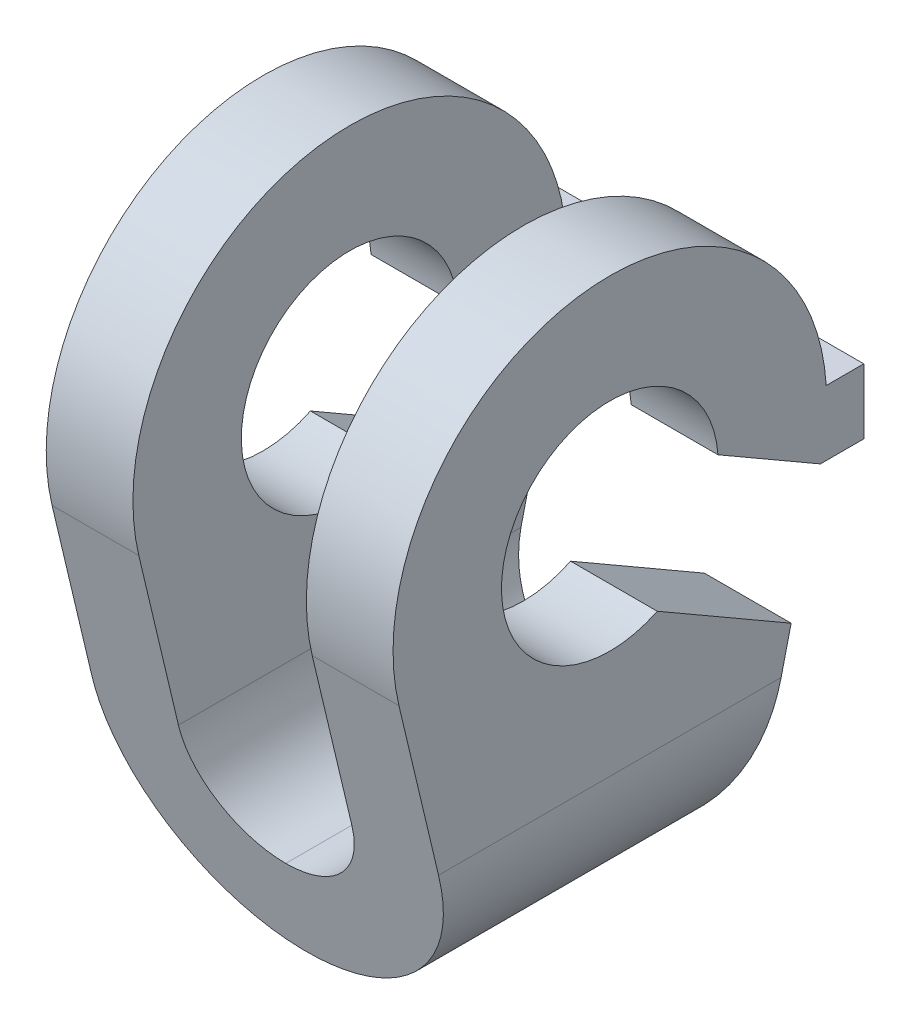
ISO-10303-21;
HEADER;
FILE_DESCRIPTION(('STEP AP214'),'2;1');
FILE_NAME('part.step','',(''),(''),'','','');
FILE_SCHEMA(('AUTOMOTIVE_DESIGN { 1 0 10303 214 1 1 1 1 }'));
ENDSEC;
DATA;
#1=APPLICATION_CONTEXT('core data for automotive mechanical design processes');
#2=APPLICATION_PROTOCOL_DEFINITION('international standard','automotive_design',2000,#1);
#3=PRODUCT_CONTEXT('',#1,'mechanical');
#4=PRODUCT('Part','Part','',(#3));
#5=PRODUCT_RELATED_PRODUCT_CATEGORY('part','',(#4));
#6=PRODUCT_DEFINITION_FORMATION('','',#4);
#7=PRODUCT_DEFINITION_CONTEXT('part definition',#1,'design');
#8=PRODUCT_DEFINITION('design','',#6,#7);
#9=PRODUCT_DEFINITION_SHAPE('','',#8);
#10=(LENGTH_UNIT() NAMED_UNIT(*) SI_UNIT(.MILLI.,.METRE.));
#11=(NAMED_UNIT(*) PLANE_ANGLE_UNIT() SI_UNIT($,.RADIAN.));
#12=(NAMED_UNIT(*) SI_UNIT($,.STERADIAN.) SOLID_ANGLE_UNIT());
#13=UNCERTAINTY_MEASURE_WITH_UNIT(LENGTH_MEASURE(1.E-05),#10,'distance_accuracy_value','');
#14=(GEOMETRIC_REPRESENTATION_CONTEXT(3) GLOBAL_UNCERTAINTY_ASSIGNED_CONTEXT((#13)) GLOBAL_UNIT_ASSIGNED_CONTEXT((#10,
#11,#12)) REPRESENTATION_CONTEXT('',''));
#15=CARTESIAN_POINT('',(0.,0.,0.));
#16=DIRECTION('',(0.,0.,1.));
#17=DIRECTION('',(1.,0.,0.));
#18=AXIS2_PLACEMENT_3D('',#15,#16,#17);
#19=CARTESIAN_POINT('',(-1.,0.,5.));
#20=DIRECTION('',(-1.,0.,0.));
#21=DIRECTION('',(0.,0.,1.));
#22=AXIS2_PLACEMENT_3D('',#19,#20,#21);
#23=PLANE('',#22);
#24=DIRECTION('',(0.,-0.499999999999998,-0.86602540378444));
#25=VECTOR('',#24,1.);
#26=CARTESIAN_POINT('',(-1.,4.31374953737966,2.50945554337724));
#27=LINE('',#26,#25);
#28=CARTESIAN_POINT('',(-1.,3.58840990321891,1.25313044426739));
#29=VERTEX_POINT('',#28);
#30=CARTESIAN_POINT('',(-0.999999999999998,2.90621284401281,0.0715124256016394));
#31=VERTEX_POINT('',#30);
#32=EDGE_CURVE('E252',#29,#31,#27,.T.);
#33=ORIENTED_EDGE('',*,*,#32,.T.);
#34=CARTESIAN_POINT('',(-0.999999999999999,3.5,2.5));
#35=DIRECTION('',(-1.,0.,0.));
#36=DIRECTION('',(0.,0.,1.));
#37=AXIS2_PLACEMENT_3D('',#34,#35,#36);
#38=CIRCLE('',#37,2.5);
#39=CARTESIAN_POINT('',(-1.,3.65621778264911,0.00488557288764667));
#40=VERTEX_POINT('',#39);
#41=EDGE_CURVE('E37',#31,#40,#38,.F.);
#42=ORIENTED_EDGE('',*,*,#41,.T.);
#43=CARTESIAN_POINT('',(-0.999999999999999,2.92185481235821,4.93223110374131));
#44=VERTEX_POINT('',#43);
#45=EDGE_CURVE('E405',#40,#44,#38,.F.);
#46=ORIENTED_EDGE('',*,*,#45,.T.);
#47=DIRECTION('',(0.,-0.972892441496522,-0.231258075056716));
#48=VECTOR('',#47,1.);
#49=CARTESIAN_POINT('',(-1.,0.171508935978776,4.27846953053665));
#50=LINE('',#49,#48);
#51=CARTESIAN_POINT('',(-1.,1.,4.47540316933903));
#52=VERTEX_POINT('',#51);
#53=EDGE_CURVE('E383',#44,#52,#50,.T.);
#54=ORIENTED_EDGE('',*,*,#53,.T.);
#55=DIRECTION('',(0.,0.,-1.));
#56=VECTOR('',#55,1.);
#57=CARTESIAN_POINT('',(-1.,1.,0.));
#58=LINE('',#57,#56);
#59=CARTESIAN_POINT('',(-1.,1.,0.524596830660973));
#60=VERTEX_POINT('',#59);
#61=EDGE_CURVE('E347',#52,#60,#58,.T.);
#62=ORIENTED_EDGE('',*,*,#61,.T.);
#63=DIRECTION('',(0.,0.972892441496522,-0.231258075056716));
#64=VECTOR('',#63,1.);
#65=CARTESIAN_POINT('',(-1.,-0.953437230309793,0.988931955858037));
#66=LINE('',#65,#64);
#67=CARTESIAN_POINT('',(-1.,1.48469231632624,0.409384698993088));
#68=VERTEX_POINT('',#67);
#69=EDGE_CURVE('E396',#60,#68,#66,.T.);
#70=ORIENTED_EDGE('',*,*,#69,.T.);
#71=DIRECTION('',(0.,0.499999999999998,0.86602540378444));
#72=VECTOR('',#71,1.);
#73=CARTESIAN_POINT('',(-1.,3.10131397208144,3.20945554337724));
#74=LINE('',#73,#72);
#75=CARTESIAN_POINT('',(-1.,2.37597433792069,1.95313044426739));
#76=VERTEX_POINT('',#75);
#77=EDGE_CURVE('E59',#68,#76,#74,.T.);
#78=ORIENTED_EDGE('',*,*,#77,.T.);
#79=CARTESIAN_POINT('',(-1.,3.5,2.5));
#80=DIRECTION('',(-1.,0.,0.));
#81=DIRECTION('',(0.,0.,1.));
#82=AXIS2_PLACEMENT_3D('',#79,#80,#81);
#83=CIRCLE('',#82,1.25);
#84=EDGE_CURVE('E357',#76,#29,#83,.T.);
#85=ORIENTED_EDGE('',*,*,#84,.T.);
#86=EDGE_LOOP('',(#33,#42,#46,#54,#62,#70,#78,#85));
#87=FACE_BOUND('',#86,.T.);
#88=ADVANCED_FACE('F33',(#87),#23,.F.);
#89=CARTESIAN_POINT('',(-2.,6.,5.));
#90=DIRECTION('',(1.,0.,0.));
#91=DIRECTION('',(0.,1.,0.));
#92=AXIS2_PLACEMENT_3D('',#89,#90,#91);
#93=PLANE('',#92);
#94=CARTESIAN_POINT('',(-2.,3.5,2.5));
#95=DIRECTION('',(1.,0.,0.));
#96=DIRECTION('',(0.,1.,0.));
#97=AXIS2_PLACEMENT_3D('',#94,#95,#96);
#98=CIRCLE('',#97,2.5);
#99=CARTESIAN_POINT('',(-2.,2.92185481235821,4.93223110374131));
#100=VERTEX_POINT('',#99);
#101=CARTESIAN_POINT('',(-2.,3.65621778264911,0.00488557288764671));
#102=VERTEX_POINT('',#101);
#103=EDGE_CURVE('E399',#100,#102,#98,.F.);
#104=ORIENTED_EDGE('',*,*,#103,.T.);
#105=DIRECTION('',(0.,0.,-1.));
#106=VECTOR('',#105,1.);
#107=CARTESIAN_POINT('',(-2.,3.65621778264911,-0.428460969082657));
#108=LINE('',#107,#106);
#109=CARTESIAN_POINT('',(-2.,3.65621778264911,-0.428460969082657));
#110=VERTEX_POINT('',#109);
#111=EDGE_CURVE('E449',#102,#110,#108,.T.);
#112=ORIENTED_EDGE('',*,*,#111,.T.);
#113=DIRECTION('',(0.,-1.,0.));
#114=VECTOR('',#113,1.);
#115=CARTESIAN_POINT('',(-2.,2.90621778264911,-0.428460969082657));
#116=LINE('',#115,#114);
#117=CARTESIAN_POINT('',(-2.,2.90621778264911,-0.428460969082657));
#118=VERTEX_POINT('',#117);
#119=EDGE_CURVE('E198',#110,#118,#116,.T.);
#120=ORIENTED_EDGE('',*,*,#119,.T.);
#121=DIRECTION('',(0.,0.,1.));
#122=VECTOR('',#121,1.);
#123=CARTESIAN_POINT('',(-2.,2.90621778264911,0.071539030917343));
#124=LINE('',#123,#122);
#125=CARTESIAN_POINT('',(-2.,2.90621778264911,0.0715124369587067));
#126=VERTEX_POINT('',#125);
#127=EDGE_CURVE('E181',#118,#126,#124,.T.);
#128=ORIENTED_EDGE('',*,*,#127,.T.);
#129=DIRECTION('',(0.,0.499999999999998,0.86602540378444));
#130=VECTOR('',#129,1.);
#131=CARTESIAN_POINT('',(-2.,5.81374953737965,5.10753175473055));
#132=LINE('',#131,#130);
#133=CARTESIAN_POINT('',(-2.,3.58840990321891,1.25313044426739));
#134=VERTEX_POINT('',#133);
#135=EDGE_CURVE('E249',#126,#134,#132,.T.);
#136=ORIENTED_EDGE('',*,*,#135,.T.);
#137=CARTESIAN_POINT('',(-2.,3.5,2.5));
#138=DIRECTION('',(1.,0.,0.));
#139=DIRECTION('',(0.,1.,0.));
#140=AXIS2_PLACEMENT_3D('',#137,#138,#139);
#141=CIRCLE('',#140,1.25);
#142=CARTESIAN_POINT('',(-2.,2.37597433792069,1.95313044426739));
#143=VERTEX_POINT('',#142);
#144=EDGE_CURVE('E365',#134,#143,#141,.T.);
#145=ORIENTED_EDGE('',*,*,#144,.T.);
#146=DIRECTION('',(0.,-0.499999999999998,-0.86602540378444));
#147=VECTOR('',#146,1.);
#148=CARTESIAN_POINT('',(-2.,4.60131397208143,5.80753175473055));
#149=LINE('',#148,#147);
#150=CARTESIAN_POINT('',(-2.,1.48469231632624,0.409384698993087));
#151=VERTEX_POINT('',#150);
#152=EDGE_CURVE('E463',#143,#151,#149,.T.);
#153=ORIENTED_EDGE('',*,*,#152,.T.);
#154=DIRECTION('',(0.,-0.972892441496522,0.231258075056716));
#155=VECTOR('',#154,1.);
#156=CARTESIAN_POINT('',(-2.,4.72568098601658,-0.361003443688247));
#157=LINE('',#156,#155);
#158=CARTESIAN_POINT('',(-2.,1.,0.524596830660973));
#159=VERTEX_POINT('',#158);
#160=EDGE_CURVE('E382',#151,#159,#157,.T.);
#161=ORIENTED_EDGE('',*,*,#160,.T.);
#162=DIRECTION('',(0.,0.,-1.));
#163=VECTOR('',#162,1.);
#164=CARTESIAN_POINT('',(-2.,1.,5.));
#165=LINE('',#164,#163);
#166=CARTESIAN_POINT('',(-2.,1.,4.47540316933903));
#167=VERTEX_POINT('',#166);
#168=EDGE_CURVE('E346',#159,#167,#165,.F.);
#169=ORIENTED_EDGE('',*,*,#168,.T.);
#170=DIRECTION('',(0.,0.972892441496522,0.231258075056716));
#171=VECTOR('',#170,1.);
#172=CARTESIAN_POINT('',(-2.,5.85062715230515,5.62840493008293));
#173=LINE('',#172,#171);
#174=EDGE_CURVE('E432',#167,#100,#173,.T.);
#175=ORIENTED_EDGE('',*,*,#174,.T.);
#176=EDGE_LOOP('',(#104,#112,#120,#128,#136,#145,#153,#161,#169,#175));
#177=FACE_BOUND('',#176,.T.);
#178=ADVANCED_FACE('F318',(#177),#93,.F.);
#179=CARTESIAN_POINT('',(2.,6.,5.));
#180=DIRECTION('',(-1.,0.,0.));
#181=DIRECTION('',(0.,-1.,0.));
#182=AXIS2_PLACEMENT_3D('',#179,#180,#181);
#183=PLANE('',#182);
#184=DIRECTION('',(0.,0.499999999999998,0.86602540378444));
#185=VECTOR('',#184,1.);
#186=CARTESIAN_POINT('',(2.,4.10621778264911,2.15));
#187=LINE('',#186,#185);
#188=CARTESIAN_POINT('',(2.,2.90621778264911,0.0715124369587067));
#189=VERTEX_POINT('',#188);
#190=CARTESIAN_POINT('',(2.,3.58840990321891,1.25313044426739));
#191=VERTEX_POINT('',#190);
#192=EDGE_CURVE('E171',#189,#191,#187,.T.);
#193=ORIENTED_EDGE('',*,*,#192,.F.);
#194=DIRECTION('',(0.,0.,-1.));
#195=VECTOR('',#194,1.);
#196=CARTESIAN_POINT('',(2.,2.90621778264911,0.071539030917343));
#197=LINE('',#196,#195);
#198=CARTESIAN_POINT('',(2.,2.90621778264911,-0.428460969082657));
#199=VERTEX_POINT('',#198);
#200=EDGE_CURVE('E165',#189,#199,#197,.T.);
#201=ORIENTED_EDGE('',*,*,#200,.T.);
#202=DIRECTION('',(0.,1.,0.));
#203=VECTOR('',#202,1.);
#204=CARTESIAN_POINT('',(2.,2.90621778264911,-0.428460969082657));
#205=LINE('',#204,#203);
#206=CARTESIAN_POINT('',(2.,3.65621778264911,-0.428460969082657));
#207=VERTEX_POINT('',#206);
#208=EDGE_CURVE('E169',#199,#207,#205,.T.);
#209=ORIENTED_EDGE('',*,*,#208,.T.);
#210=DIRECTION('',(0.,0.,1.));
#211=VECTOR('',#210,1.);
#212=CARTESIAN_POINT('',(2.,3.65621778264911,-0.428460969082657));
#213=LINE('',#212,#211);
#214=CARTESIAN_POINT('',(2.,3.65621778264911,0.00488557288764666));
#215=VERTEX_POINT('',#214);
#216=EDGE_CURVE('E51',#207,#215,#213,.T.);
#217=ORIENTED_EDGE('',*,*,#216,.T.);
#218=CARTESIAN_POINT('',(2.,3.5,2.5));
#219=DIRECTION('',(-1.,0.,0.));
#220=DIRECTION('',(0.,-1.,0.));
#221=AXIS2_PLACEMENT_3D('',#218,#219,#220);
#222=CIRCLE('',#221,2.5);
#223=CARTESIAN_POINT('',(2.,2.92185481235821,4.93223110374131));
#224=VERTEX_POINT('',#223);
#225=EDGE_CURVE('E403',#215,#224,#222,.F.);
#226=ORIENTED_EDGE('',*,*,#225,.T.);
#227=DIRECTION('',(0.,-0.972892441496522,-0.231258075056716));
#228=VECTOR('',#227,1.);
#229=CARTESIAN_POINT('',(2.,5.85062715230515,5.62840493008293));
#230=LINE('',#229,#228);
#231=CARTESIAN_POINT('',(2.,1.,4.47540316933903));
#232=VERTEX_POINT('',#231);
#233=EDGE_CURVE('E430',#224,#232,#230,.T.);
#234=ORIENTED_EDGE('',*,*,#233,.T.);
#235=DIRECTION('',(0.,0.,-1.));
#236=VECTOR('',#235,1.);
#237=CARTESIAN_POINT('',(2.,1.,5.));
#238=LINE('',#237,#236);
#239=CARTESIAN_POINT('',(2.,1.,0.524596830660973));
#240=VERTEX_POINT('',#239);
#241=EDGE_CURVE('E350',#232,#240,#238,.T.);
#242=ORIENTED_EDGE('',*,*,#241,.T.);
#243=DIRECTION('',(0.,0.972892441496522,-0.231258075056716));
#244=VECTOR('',#243,1.);
#245=CARTESIAN_POINT('',(2.,4.72568098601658,-0.361003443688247));
#246=LINE('',#245,#244);
#247=CARTESIAN_POINT('',(2.,1.48469231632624,0.409384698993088));
#248=VERTEX_POINT('',#247);
#249=EDGE_CURVE('E374',#240,#248,#246,.T.);
#250=ORIENTED_EDGE('',*,*,#249,.T.);
#251=DIRECTION('',(0.,-0.499999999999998,-0.86602540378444));
#252=VECTOR('',#251,1.);
#253=CARTESIAN_POINT('',(2.,2.89378221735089,2.85));
#254=LINE('',#253,#252);
#255=CARTESIAN_POINT('',(2.,2.37597433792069,1.95313044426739));
#256=VERTEX_POINT('',#255);
#257=EDGE_CURVE('E234',#256,#248,#254,.T.);
#258=ORIENTED_EDGE('',*,*,#257,.F.);
#259=CARTESIAN_POINT('',(2.,3.5,2.5));
#260=DIRECTION('',(1.,0.,0.));
#261=DIRECTION('',(0.,1.,0.));
#262=AXIS2_PLACEMENT_3D('',#259,#260,#261);
#263=CIRCLE('',#262,1.25);
#264=EDGE_CURVE('E411',#191,#256,#263,.T.);
#265=ORIENTED_EDGE('',*,*,#264,.F.);
#266=EDGE_LOOP('',(#193,#201,#209,#217,#226,#234,#242,#250,#258,#265));
#267=FACE_BOUND('',#266,.T.);
#268=ADVANCED_FACE('F167',(#267),#183,.F.);
#269=CARTESIAN_POINT('',(1.,0.,5.));
#270=DIRECTION('',(1.,0.,0.));
#271=DIRECTION('',(0.,0.,-1.));
#272=AXIS2_PLACEMENT_3D('',#269,#270,#271);
#273=PLANE('',#272);
#274=CARTESIAN_POINT('',(1.,3.5,2.5));
#275=DIRECTION('',(1.,0.,0.));
#276=DIRECTION('',(0.,0.,-1.));
#277=AXIS2_PLACEMENT_3D('',#274,#275,#276);
#278=CIRCLE('',#277,2.5);
#279=CARTESIAN_POINT('',(0.999999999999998,3.65621778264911,0.00488557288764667));
#280=VERTEX_POINT('',#279);
#281=CARTESIAN_POINT('',(1.,2.90621284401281,0.0715124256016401));
#282=VERTEX_POINT('',#281);
#283=EDGE_CURVE('E241',#280,#282,#278,.F.);
#284=ORIENTED_EDGE('',*,*,#283,.T.);
#285=DIRECTION('',(0.,0.499999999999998,0.86602540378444));
#286=VECTOR('',#285,1.);
#287=CARTESIAN_POINT('',(1.,4.31374953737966,2.50945554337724));
#288=LINE('',#287,#286);
#289=CARTESIAN_POINT('',(1.,3.58840990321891,1.25313044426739));
#290=VERTEX_POINT('',#289);
#291=EDGE_CURVE('E254',#282,#290,#288,.T.);
#292=ORIENTED_EDGE('',*,*,#291,.T.);
#293=CARTESIAN_POINT('',(1.,3.5,2.5));
#294=DIRECTION('',(1.,0.,0.));
#295=DIRECTION('',(0.,0.,-1.));
#296=AXIS2_PLACEMENT_3D('',#293,#294,#295);
#297=CIRCLE('',#296,1.25);
#298=CARTESIAN_POINT('',(1.,2.37597433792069,1.95313044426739));
#299=VERTEX_POINT('',#298);
#300=EDGE_CURVE('E362',#290,#299,#297,.T.);
#301=ORIENTED_EDGE('',*,*,#300,.T.);
#302=DIRECTION('',(0.,-0.499999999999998,-0.86602540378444));
#303=VECTOR('',#302,1.);
#304=CARTESIAN_POINT('',(1.,3.10131397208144,3.20945554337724));
#305=LINE('',#304,#303);
#306=CARTESIAN_POINT('',(0.999999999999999,1.48469231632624,0.409384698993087));
#307=VERTEX_POINT('',#306);
#308=EDGE_CURVE('E244',#299,#307,#305,.T.);
#309=ORIENTED_EDGE('',*,*,#308,.T.);
#310=DIRECTION('',(0.,-0.972892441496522,0.231258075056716));
#311=VECTOR('',#310,1.);
#312=CARTESIAN_POINT('',(1.,-0.953437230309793,0.988931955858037));
#313=LINE('',#312,#311);
#314=CARTESIAN_POINT('',(1.,1.,0.524596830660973));
#315=VERTEX_POINT('',#314);
#316=EDGE_CURVE('E375',#307,#315,#313,.T.);
#317=ORIENTED_EDGE('',*,*,#316,.T.);
#318=DIRECTION('',(0.,0.,-1.));
#319=VECTOR('',#318,1.);
#320=CARTESIAN_POINT('',(1.,1.,5.));
#321=LINE('',#320,#319);
#322=CARTESIAN_POINT('',(1.,1.,4.47540316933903));
#323=VERTEX_POINT('',#322);
#324=EDGE_CURVE('E339',#315,#323,#321,.F.);
#325=ORIENTED_EDGE('',*,*,#324,.T.);
#326=DIRECTION('',(0.,0.972892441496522,0.231258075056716));
#327=VECTOR('',#326,1.);
#328=CARTESIAN_POINT('',(1.,0.171508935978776,4.27846953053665));
#329=LINE('',#328,#327);
#330=CARTESIAN_POINT('',(0.999999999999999,2.92185481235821,4.93223110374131));
#331=VERTEX_POINT('',#330);
#332=EDGE_CURVE('E388',#323,#331,#329,.T.);
#333=ORIENTED_EDGE('',*,*,#332,.T.);
#334=CARTESIAN_POINT('',(0.999999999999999,3.5,2.5));
#335=DIRECTION('',(1.,0.,0.));
#336=DIRECTION('',(0.,0.,-1.));
#337=AXIS2_PLACEMENT_3D('',#334,#335,#336);
#338=CIRCLE('',#337,2.5);
#339=EDGE_CURVE('E400',#331,#280,#338,.F.);
#340=ORIENTED_EDGE('',*,*,#339,.T.);
#341=EDGE_LOOP('',(#284,#292,#301,#309,#317,#325,#333,#340));
#342=FACE_BOUND('',#341,.T.);
#343=ADVANCED_FACE('F289',(#342),#273,.F.);
#344=CARTESIAN_POINT('',(-8.,4.10621778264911,2.15));
#345=DIRECTION('',(0.,0.86602540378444,-0.499999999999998));
#346=DIRECTION('',(0.,0.499999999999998,0.86602540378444));
#347=AXIS2_PLACEMENT_3D('',#344,#345,#346);
#348=PLANE('',#347);
#349=CARTESIAN_POINT('',(-2.,2.90621778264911,0.0715390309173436));
#350=DIRECTION('',(1.,0.,0.));
#351=VECTOR('',#350,1.);
#352=LINE('',#349,#351);
#353=EDGE_CURVE('E275',#126,#31,#352,.T.);
#354=ORIENTED_EDGE('',*,*,#353,.T.);
#355=ORIENTED_EDGE('',*,*,#32,.F.);
#356=DIRECTION('',(1.,0.,0.));
#357=VECTOR('',#356,1.);
#358=CARTESIAN_POINT('',(-2.,3.58840990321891,1.25313044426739));
#359=LINE('',#358,#357);
#360=EDGE_CURVE('E262',#134,#29,#359,.T.);
#361=ORIENTED_EDGE('',*,*,#360,.F.);
#362=ORIENTED_EDGE('',*,*,#135,.F.);
#363=EDGE_LOOP('',(#354,#355,#361,#362));
#364=FACE_BOUND('',#363,.T.);
#365=ADVANCED_FACE('F279',(#364),#348,.F.);
#366=CARTESIAN_POINT('',(1.,2.90621778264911,0.071539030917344));
#367=DIRECTION('',(1.,0.,0.));
#368=VECTOR('',#367,1.);
#369=LINE('',#366,#368);
#370=EDGE_CURVE('E211',#282,#189,#369,.T.);
#371=ORIENTED_EDGE('',*,*,#370,.T.);
#372=ORIENTED_EDGE('',*,*,#192,.T.);
#373=DIRECTION('',(1.,0.,0.));
#374=VECTOR('',#373,1.);
#375=CARTESIAN_POINT('',(-2.,3.58840990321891,1.25313044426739));
#376=LINE('',#375,#374);
#377=EDGE_CURVE('E419',#290,#191,#376,.T.);
#378=ORIENTED_EDGE('',*,*,#377,.F.);
#379=ORIENTED_EDGE('',*,*,#291,.F.);
#380=EDGE_LOOP('',(#371,#372,#378,#379));
#381=FACE_BOUND('',#380,.T.);
#382=ADVANCED_FACE('F288',(#381),#348,.F.);
#383=CARTESIAN_POINT('',(0.,1.,5.));
#384=DIRECTION('',(0.,0.,1.));
#385=DIRECTION('',(1.,0.,0.));
#386=AXIS2_PLACEMENT_3D('',#383,#384,#385);
#387=CYLINDRICAL_SURFACE('',#386,1.);
#388=ORIENTED_EDGE('',*,*,#324,.F.);
#389=CARTESIAN_POINT('',(0.,1.,0.524596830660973));
#390=DIRECTION('',(0.,0.231258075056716,0.972892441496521));
#391=DIRECTION('',(0.,-0.972892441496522,0.231258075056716));
#392=AXIS2_PLACEMENT_3D('',#389,#390,#391);
#393=ELLIPSE('',#392,1.02786285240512,1.);
#394=CARTESIAN_POINT('',(0.,0.,0.762298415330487));
#395=VERTEX_POINT('',#394);
#396=EDGE_CURVE('E342',#315,#395,#393,.F.);
#397=ORIENTED_EDGE('',*,*,#396,.T.);
#398=DIRECTION('',(0.,0.,-1.));
#399=VECTOR('',#398,1.);
#400=CARTESIAN_POINT('',(0.,0.,0.));
#401=LINE('',#400,#399);
#402=CARTESIAN_POINT('',(0.,0.,4.23770158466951));
#403=VERTEX_POINT('',#402);
#404=EDGE_CURVE('E353',#403,#395,#401,.T.);
#405=ORIENTED_EDGE('',*,*,#404,.F.);
#406=CARTESIAN_POINT('',(0.,1.,4.47540316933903));
#407=DIRECTION('',(0.,0.231258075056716,-0.972892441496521));
#408=DIRECTION('',(0.,0.972892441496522,0.231258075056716));
#409=AXIS2_PLACEMENT_3D('',#406,#407,#408);
#410=ELLIPSE('',#409,1.02786285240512,1.);
#411=EDGE_CURVE('E344',#403,#323,#410,.F.);
#412=ORIENTED_EDGE('',*,*,#411,.T.);
#413=EDGE_LOOP('',(#388,#397,#405,#412));
#414=FACE_BOUND('',#413,.T.);
#415=ADVANCED_FACE('F327',(#414),#387,.F.);
#416=CARTESIAN_POINT('',(0.,1.,5.));
#417=DIRECTION('',(0.,0.,1.));
#418=DIRECTION('',(1.,0.,0.));
#419=AXIS2_PLACEMENT_3D('',#416,#417,#418);
#420=CYLINDRICAL_SURFACE('',#419,1.);
#421=ORIENTED_EDGE('',*,*,#404,.T.);
#422=CARTESIAN_POINT('',(0.,1.,0.524596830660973));
#423=DIRECTION('',(0.,0.231258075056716,0.972892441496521));
#424=DIRECTION('',(0.,-0.972892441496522,0.231258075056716));
#425=AXIS2_PLACEMENT_3D('',#422,#423,#424);
#426=ELLIPSE('',#425,1.02786285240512,1.);
#427=EDGE_CURVE('E385',#395,#60,#426,.F.);
#428=ORIENTED_EDGE('',*,*,#427,.T.);
#429=ORIENTED_EDGE('',*,*,#61,.F.);
#430=CARTESIAN_POINT('',(0.,1.,4.47540316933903));
#431=DIRECTION('',(0.,0.231258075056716,-0.972892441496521));
#432=DIRECTION('',(0.,0.972892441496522,0.231258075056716));
#433=AXIS2_PLACEMENT_3D('',#430,#431,#432);
#434=ELLIPSE('',#433,1.02786285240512,1.);
#435=EDGE_CURVE('E435',#52,#403,#434,.F.);
#436=ORIENTED_EDGE('',*,*,#435,.T.);
#437=EDGE_LOOP('',(#421,#428,#429,#436));
#438=FACE_BOUND('',#437,.T.);
#439=ADVANCED_FACE('F325',(#438),#420,.F.);
#440=CARTESIAN_POINT('',(0.,1.,5.));
#441=DIRECTION('',(0.,0.,-1.));
#442=DIRECTION('',(-1.,0.,0.));
#443=AXIS2_PLACEMENT_3D('',#440,#441,#442);
#444=CYLINDRICAL_SURFACE('',#443,2.);
#445=CARTESIAN_POINT('',(0.,1.,0.524596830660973));
#446=DIRECTION('',(0.,0.231258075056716,0.972892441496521));
#447=DIRECTION('',(0.,0.972892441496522,-0.231258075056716));
#448=AXIS2_PLACEMENT_3D('',#445,#446,#447);
#449=ELLIPSE('',#448,2.05572570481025,2.);
#450=EDGE_CURVE('E366',#240,#159,#449,.F.);
#451=ORIENTED_EDGE('',*,*,#450,.F.);
#452=ORIENTED_EDGE('',*,*,#241,.F.);
#453=CARTESIAN_POINT('',(0.,1.,4.47540316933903));
#454=DIRECTION('',(0.,0.231258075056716,-0.972892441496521));
#455=DIRECTION('',(0.,-0.972892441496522,-0.231258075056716));
#456=AXIS2_PLACEMENT_3D('',#453,#454,#455);
#457=ELLIPSE('',#456,2.05572570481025,2.);
#458=EDGE_CURVE('E361',#167,#232,#457,.F.);
#459=ORIENTED_EDGE('',*,*,#458,.F.);
#460=ORIENTED_EDGE('',*,*,#168,.F.);
#461=EDGE_LOOP('',(#451,#452,#459,#460));
#462=FACE_BOUND('',#461,.T.);
#463=ADVANCED_FACE('F35',(#462),#444,.T.);
#464=CARTESIAN_POINT('',(-2.,3.5,2.5));
#465=DIRECTION('',(1.,0.,0.));
#466=DIRECTION('',(0.,1.,0.));
#467=AXIS2_PLACEMENT_3D('',#464,#465,#466);
#468=CYLINDRICAL_SURFACE('',#467,1.25);
#469=ORIENTED_EDGE('',*,*,#300,.F.);
#470=ORIENTED_EDGE('',*,*,#377,.T.);
#471=ORIENTED_EDGE('',*,*,#264,.T.);
#472=DIRECTION('',(1.,0.,0.));
#473=VECTOR('',#472,1.);
#474=CARTESIAN_POINT('',(-2.,2.37597433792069,1.95313044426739));
#475=LINE('',#474,#473);
#476=EDGE_CURVE('E462',#256,#299,#475,.F.);
#477=ORIENTED_EDGE('',*,*,#476,.T.);
#478=EDGE_LOOP('',(#469,#470,#471,#477));
#479=FACE_BOUND('',#478,.T.);
#480=ADVANCED_FACE('F311',(#479),#468,.F.);
#481=ORIENTED_EDGE('',*,*,#144,.F.);
#482=ORIENTED_EDGE('',*,*,#360,.T.);
#483=ORIENTED_EDGE('',*,*,#84,.F.);
#484=DIRECTION('',(1.,0.,0.));
#485=VECTOR('',#484,1.);
#486=CARTESIAN_POINT('',(-2.,2.37597433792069,1.95313044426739));
#487=LINE('',#486,#485);
#488=EDGE_CURVE('E253',#76,#143,#487,.F.);
#489=ORIENTED_EDGE('',*,*,#488,.T.);
#490=EDGE_LOOP('',(#481,#482,#483,#489));
#491=FACE_BOUND('',#490,.T.);
#492=ADVANCED_FACE('F304',(#491),#468,.F.);
#493=CARTESIAN_POINT('',(10.,3.5,2.5));
#494=DIRECTION('',(-1.,0.,0.));
#495=DIRECTION('',(0.,0.,1.));
#496=AXIS2_PLACEMENT_3D('',#493,#494,#495);
#497=CYLINDRICAL_SURFACE('',#496,2.5);
#498=ORIENTED_EDGE('',*,*,#45,.F.);
#499=DIRECTION('',(1.,0.,0.));
#500=VECTOR('',#499,1.);
#501=CARTESIAN_POINT('',(-2.901387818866,3.65621778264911,0.00488557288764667));
#502=LINE('',#501,#500);
#503=EDGE_CURVE('E195',#102,#40,#502,.T.);
#504=ORIENTED_EDGE('',*,*,#503,.F.);
#505=ORIENTED_EDGE('',*,*,#103,.F.);
#506=DIRECTION('',(-1.,0.,0.));
#507=VECTOR('',#506,1.);
#508=CARTESIAN_POINT('',(10.,2.92185481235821,4.93223110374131));
#509=LINE('',#508,#507);
#510=EDGE_CURVE('E423',#44,#100,#509,.T.);
#511=ORIENTED_EDGE('',*,*,#510,.F.);
#512=EDGE_LOOP('',(#498,#504,#505,#511));
#513=FACE_BOUND('',#512,.T.);
#514=ADVANCED_FACE('F300',(#513),#497,.T.);
#515=ORIENTED_EDGE('',*,*,#225,.F.);
#516=EDGE_CURVE('E200',#280,#215,#502,.T.);
#517=ORIENTED_EDGE('',*,*,#516,.F.);
#518=ORIENTED_EDGE('',*,*,#339,.F.);
#519=EDGE_CURVE('E427',#224,#331,#509,.T.);
#520=ORIENTED_EDGE('',*,*,#519,.F.);
#521=EDGE_LOOP('',(#515,#517,#518,#520));
#522=FACE_BOUND('',#521,.T.);
#523=ADVANCED_FACE('F303',(#522),#497,.T.);
#524=CARTESIAN_POINT('',(10.,2.92185481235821,0.0677688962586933));
#525=DIRECTION('',(0.,0.231258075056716,0.972892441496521));
#526=DIRECTION('',(0.,-0.972892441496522,0.231258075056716));
#527=AXIS2_PLACEMENT_3D('',#524,#525,#526);
#528=PLANE('',#527);
#529=ORIENTED_EDGE('',*,*,#160,.F.);
#530=DIRECTION('',(1.,0.,0.));
#531=VECTOR('',#530,1.);
#532=CARTESIAN_POINT('',(10.,1.48469231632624,0.409384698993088));
#533=LINE('',#532,#531);
#534=EDGE_CURVE('E11',#151,#68,#533,.T.);
#535=ORIENTED_EDGE('',*,*,#534,.T.);
#536=ORIENTED_EDGE('',*,*,#69,.F.);
#537=ORIENTED_EDGE('',*,*,#427,.F.);
#538=ORIENTED_EDGE('',*,*,#396,.F.);
#539=ORIENTED_EDGE('',*,*,#316,.F.);
#540=EDGE_CURVE('E43',#307,#248,#533,.T.);
#541=ORIENTED_EDGE('',*,*,#540,.T.);
#542=ORIENTED_EDGE('',*,*,#249,.F.);
#543=ORIENTED_EDGE('',*,*,#450,.T.);
#544=EDGE_LOOP('',(#529,#535,#536,#537,#538,#539,#541,#542,#543));
#545=FACE_BOUND('',#544,.T.);
#546=ADVANCED_FACE('F298',(#545),#528,.F.);
#547=CARTESIAN_POINT('',(10.,2.92185481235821,4.93223110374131));
#548=DIRECTION('',(0.,0.231258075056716,-0.972892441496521));
#549=DIRECTION('',(0.,0.972892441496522,0.231258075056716));
#550=AXIS2_PLACEMENT_3D('',#547,#548,#549);
#551=PLANE('',#550);
#552=ORIENTED_EDGE('',*,*,#510,.T.);
#553=ORIENTED_EDGE('',*,*,#174,.F.);
#554=ORIENTED_EDGE('',*,*,#458,.T.);
#555=ORIENTED_EDGE('',*,*,#233,.F.);
#556=ORIENTED_EDGE('',*,*,#519,.T.);
#557=ORIENTED_EDGE('',*,*,#332,.F.);
#558=ORIENTED_EDGE('',*,*,#411,.F.);
#559=ORIENTED_EDGE('',*,*,#435,.F.);
#560=ORIENTED_EDGE('',*,*,#53,.F.);
#561=EDGE_LOOP('',(#552,#553,#554,#555,#556,#557,#558,#559,#560));
#562=FACE_BOUND('',#561,.T.);
#563=ADVANCED_FACE('F295',(#562),#551,.F.);
#564=CARTESIAN_POINT('',(-8.,2.89378221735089,2.85));
#565=DIRECTION('',(0.,-0.86602540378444,0.499999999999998));
#566=DIRECTION('',(0.,-0.499999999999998,-0.86602540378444));
#567=AXIS2_PLACEMENT_3D('',#564,#565,#566);
#568=PLANE('',#567);
#569=ORIENTED_EDGE('',*,*,#257,.T.);
#570=ORIENTED_EDGE('',*,*,#540,.F.);
#571=ORIENTED_EDGE('',*,*,#308,.F.);
#572=ORIENTED_EDGE('',*,*,#476,.F.);
#573=EDGE_LOOP('',(#569,#570,#571,#572));
#574=FACE_BOUND('',#573,.T.);
#575=ADVANCED_FACE('F294',(#574),#568,.F.);
#576=ORIENTED_EDGE('',*,*,#77,.F.);
#577=ORIENTED_EDGE('',*,*,#534,.F.);
#578=ORIENTED_EDGE('',*,*,#152,.F.);
#579=ORIENTED_EDGE('',*,*,#488,.F.);
#580=EDGE_LOOP('',(#576,#577,#578,#579));
#581=FACE_BOUND('',#580,.T.);
#582=ADVANCED_FACE('F290',(#581),#568,.F.);
#583=CARTESIAN_POINT('',(-2.901387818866,3.5,2.5));
#584=DIRECTION('',(1.,0.,0.));
#585=DIRECTION('',(0.,1.,0.));
#586=AXIS2_PLACEMENT_3D('',#583,#584,#585);
#587=CYLINDRICAL_SURFACE('',#586,2.5);
#588=ORIENTED_EDGE('',*,*,#41,.F.);
#589=DIRECTION('',(1.,0.,0.));
#590=VECTOR('',#589,1.);
#591=CARTESIAN_POINT('',(-2.901387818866,2.90621778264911,0.071539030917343));
#592=LINE('',#591,#590);
#593=EDGE_CURVE('E185',#31,#282,#592,.T.);
#594=ORIENTED_EDGE('',*,*,#593,.T.);
#595=ORIENTED_EDGE('',*,*,#283,.F.);
#596=EDGE_CURVE('E199',#40,#280,#502,.T.);
#597=ORIENTED_EDGE('',*,*,#596,.F.);
#598=EDGE_LOOP('',(#588,#594,#595,#597));
#599=FACE_BOUND('',#598,.T.);
#600=ADVANCED_FACE('F227',(#599),#587,.F.);
#601=CARTESIAN_POINT('',(-2.901387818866,2.90621778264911,0.071539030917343));
#602=DIRECTION('',(0.,-1.,0.));
#603=DIRECTION('',(1.,0.,0.));
#604=AXIS2_PLACEMENT_3D('',#601,#602,#603);
#605=PLANE('',#604);
#606=ORIENTED_EDGE('',*,*,#353,.F.);
#607=ORIENTED_EDGE('',*,*,#127,.F.);
#608=DIRECTION('',(1.,0.,0.));
#609=VECTOR('',#608,1.);
#610=CARTESIAN_POINT('',(-2.901387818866,2.90621778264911,-0.428460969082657));
#611=LINE('',#610,#609);
#612=EDGE_CURVE('E178',#118,#199,#611,.T.);
#613=ORIENTED_EDGE('',*,*,#612,.T.);
#614=ORIENTED_EDGE('',*,*,#200,.F.);
#615=ORIENTED_EDGE('',*,*,#370,.F.);
#616=ORIENTED_EDGE('',*,*,#593,.F.);
#617=EDGE_LOOP('',(#606,#607,#613,#614,#615,#616));
#618=FACE_BOUND('',#617,.T.);
#619=ADVANCED_FACE('F179',(#618),#605,.T.);
#620=CARTESIAN_POINT('',(-2.901387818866,3.65621778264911,-0.428460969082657));
#621=DIRECTION('',(0.,1.,0.));
#622=DIRECTION('',(0.,0.,1.));
#623=AXIS2_PLACEMENT_3D('',#620,#621,#622);
#624=PLANE('',#623);
#625=ORIENTED_EDGE('',*,*,#111,.F.);
#626=ORIENTED_EDGE('',*,*,#503,.T.);
#627=ORIENTED_EDGE('',*,*,#596,.T.);
#628=ORIENTED_EDGE('',*,*,#516,.T.);
#629=ORIENTED_EDGE('',*,*,#216,.F.);
#630=DIRECTION('',(1.,0.,0.));
#631=VECTOR('',#630,1.);
#632=CARTESIAN_POINT('',(-2.901387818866,3.65621778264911,-0.428460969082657));
#633=LINE('',#632,#631);
#634=EDGE_CURVE('E184',#110,#207,#633,.T.);
#635=ORIENTED_EDGE('',*,*,#634,.F.);
#636=EDGE_LOOP('',(#625,#626,#627,#628,#629,#635));
#637=FACE_BOUND('',#636,.T.);
#638=ADVANCED_FACE('F226',(#637),#624,.T.);
#639=CARTESIAN_POINT('',(-2.901387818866,2.90621778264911,-0.428460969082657));
#640=DIRECTION('',(0.,0.,-1.));
#641=DIRECTION('',(-1.,0.,0.));
#642=AXIS2_PLACEMENT_3D('',#639,#640,#641);
#643=PLANE('',#642);
#644=ORIENTED_EDGE('',*,*,#119,.F.);
#645=ORIENTED_EDGE('',*,*,#634,.T.);
#646=ORIENTED_EDGE('',*,*,#208,.F.);
#647=ORIENTED_EDGE('',*,*,#612,.F.);
#648=EDGE_LOOP('',(#644,#645,#646,#647));
#649=FACE_BOUND('',#648,.T.);
#650=ADVANCED_FACE('F187',(#649),#643,.T.);
#651=CLOSED_SHELL('',(#88,#178,#268,#343,#365,#382,#415,#439,#463,#480,#492,#514,#523,#546,#563,
#575,#582,#600,#619,#638,#650));
#652=MANIFOLD_SOLID_BREP('B2',#651);
#653=ADVANCED_BREP_SHAPE_REPRESENTATION('',(#18,#652),#14);
#654=SHAPE_DEFINITION_REPRESENTATION(#9,#653);
ENDSEC;
END-ISO-10303-21;
